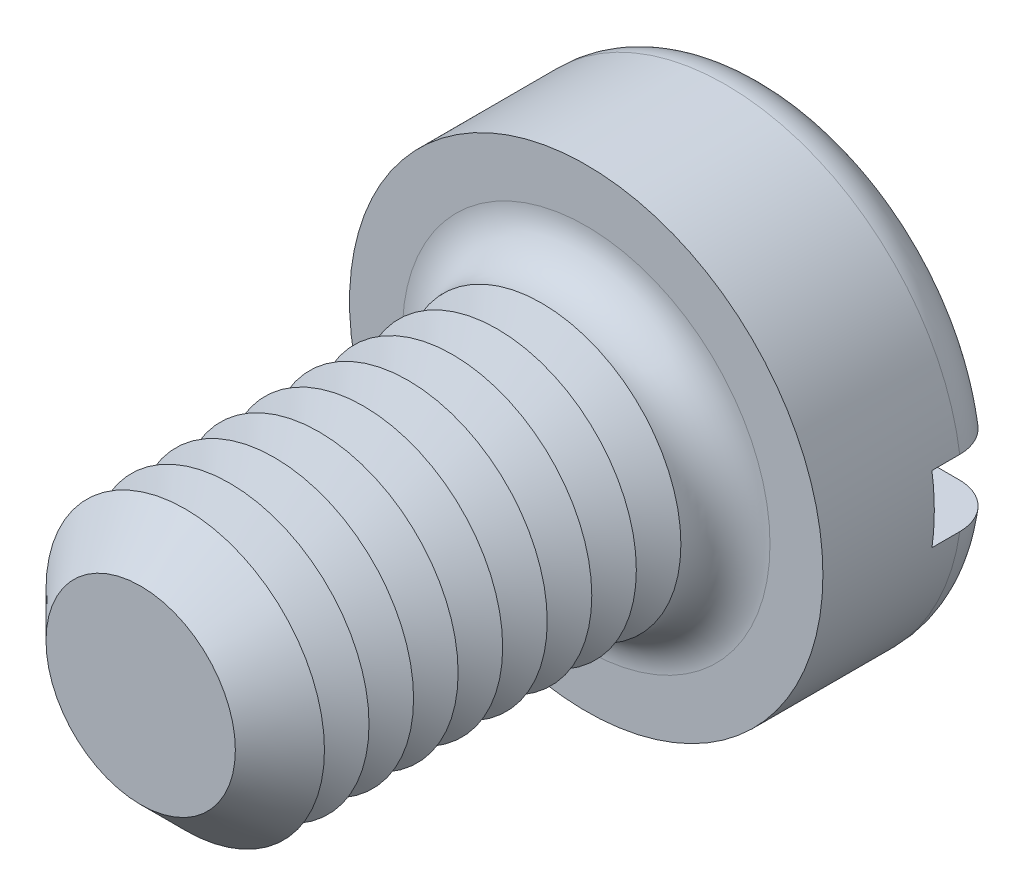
ISO-10303-21;
HEADER;
FILE_DESCRIPTION(('STEP AP214'),'2;1');
FILE_NAME('part.step','',(''),(''),'','','');
FILE_SCHEMA(('AUTOMOTIVE_DESIGN { 1 0 10303 214 1 1 1 1 }'));
ENDSEC;
DATA;
#1=APPLICATION_CONTEXT('core data for automotive mechanical design processes');
#2=APPLICATION_PROTOCOL_DEFINITION('international standard','automotive_design',2000,#1);
#3=PRODUCT_CONTEXT('',#1,'mechanical');
#4=PRODUCT('Part','Part','',(#3));
#5=PRODUCT_RELATED_PRODUCT_CATEGORY('part','',(#4));
#6=PRODUCT_DEFINITION_FORMATION('','',#4);
#7=PRODUCT_DEFINITION_CONTEXT('part definition',#1,'design');
#8=PRODUCT_DEFINITION('design','',#6,#7);
#9=PRODUCT_DEFINITION_SHAPE('','',#8);
#10=(LENGTH_UNIT() NAMED_UNIT(*) SI_UNIT(.MILLI.,.METRE.));
#11=(NAMED_UNIT(*) PLANE_ANGLE_UNIT() SI_UNIT($,.RADIAN.));
#12=(NAMED_UNIT(*) SI_UNIT($,.STERADIAN.) SOLID_ANGLE_UNIT());
#13=UNCERTAINTY_MEASURE_WITH_UNIT(LENGTH_MEASURE(1.E-05),#10,'distance_accuracy_value','');
#14=(GEOMETRIC_REPRESENTATION_CONTEXT(3) GLOBAL_UNCERTAINTY_ASSIGNED_CONTEXT((#13)) GLOBAL_UNIT_ASSIGNED_CONTEXT((#10,
#11,#12)) REPRESENTATION_CONTEXT('',''));
#15=CARTESIAN_POINT('',(0.,0.,0.));
#16=DIRECTION('',(0.,0.,1.));
#17=DIRECTION('',(1.,0.,0.));
#18=AXIS2_PLACEMENT_3D('',#15,#16,#17);
#19=CARTESIAN_POINT('',(0.,0.,-3.3));
#20=DIRECTION('',(0.,0.,1.));
#21=DIRECTION('',(1.,0.,0.));
#22=AXIS2_PLACEMENT_3D('',#19,#20,#21);
#23=PLANE('',#22);
#24=CARTESIAN_POINT('',(0.,0.,-3.3));
#25=DIRECTION('',(0.,0.,1.));
#26=DIRECTION('',(1.,0.,0.));
#27=AXIS2_PLACEMENT_3D('',#24,#25,#26);
#28=CIRCLE('',#27,3.45);
#29=CARTESIAN_POINT('',(-3.39742549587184,0.6,-3.3));
#30=VERTEX_POINT('',#29);
#31=CARTESIAN_POINT('',(3.39742549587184,0.6,-3.3));
#32=VERTEX_POINT('',#31);
#33=EDGE_CURVE('E116',#30,#32,#28,.F.);
#34=ORIENTED_EDGE('',*,*,#33,.T.);
#35=DIRECTION('',(1.,0.,0.));
#36=VECTOR('',#35,1.);
#37=CARTESIAN_POINT('',(-4.25,0.600000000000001,-3.3));
#38=LINE('',#37,#36);
#39=EDGE_CURVE('E111',#30,#32,#38,.T.);
#40=ORIENTED_EDGE('',*,*,#39,.F.);
#41=EDGE_LOOP('',(#34,#40));
#42=FACE_BOUND('',#41,.T.);
#43=ADVANCED_FACE('F39',(#42),#23,.F.);
#44=CARTESIAN_POINT('',(0.,0.,-2.5));
#45=DIRECTION('',(0.,0.,1.));
#46=DIRECTION('',(1.,0.,0.));
#47=AXIS2_PLACEMENT_3D('',#44,#45,#46);
#48=TOROIDAL_SURFACE('',#47,3.45,0.8);
#49=CARTESIAN_POINT('',(-4.06369072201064,0.600000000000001,-2.95537828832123));
#50=CARTESIAN_POINT('',(-4.03774340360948,0.600000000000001,-2.99245078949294));
#51=CARTESIAN_POINT('',(-4.00861849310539,0.600000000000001,-3.02734231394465));
#52=CARTESIAN_POINT('',(-3.94488199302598,0.600000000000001,-3.0917502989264));
#53=CARTESIAN_POINT('',(-3.91026320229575,0.600000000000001,-3.12125959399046));
#54=CARTESIAN_POINT('',(-3.83660561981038,0.600000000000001,-3.17403695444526));
#55=CARTESIAN_POINT('',(-3.79757117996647,0.6,-3.19731109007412));
#56=CARTESIAN_POINT('',(-3.71618817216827,0.6,-3.23703443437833));
#57=CARTESIAN_POINT('',(-3.67384041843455,0.6,-3.25348531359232));
#58=CARTESIAN_POINT('',(-3.58661930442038,0.6,-3.2792758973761));
#59=CARTESIAN_POINT('',(-3.54172669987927,0.6,-3.288550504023));
#60=CARTESIAN_POINT('',(-3.45102322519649,0.6,-3.29952632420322));
#61=CARTESIAN_POINT('',(-3.40521225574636,0.6,-3.30122671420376));
#62=CARTESIAN_POINT('',(-3.31340831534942,0.6,-3.29701196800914));
#63=CARTESIAN_POINT('',(-3.26741940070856,0.6,-3.29100823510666));
#64=CARTESIAN_POINT('',(-3.17708556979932,0.6,-3.27141469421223));
#65=CARTESIAN_POINT('',(-3.13274074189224,0.6,-3.25782447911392));
#66=CARTESIAN_POINT('',(-3.0466814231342,0.6,-3.22332549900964));
#67=CARTESIAN_POINT('',(-3.00498444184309,0.6,-3.20237301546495));
#68=CARTESIAN_POINT('',(-2.92572251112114,0.6,-3.15372961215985));
#69=CARTESIAN_POINT('',(-2.88815755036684,0.6,-3.12603871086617));
#70=CARTESIAN_POINT('',(-2.81847654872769,0.6,-3.06483322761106));
#71=CARTESIAN_POINT('',(-2.78633186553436,0.6,-3.03135128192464));
#72=CARTESIAN_POINT('',(-2.72824805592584,0.6,-2.95937651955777));
#73=CARTESIAN_POINT('',(-2.70230829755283,0.6,-2.92088421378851));
#74=CARTESIAN_POINT('',(-2.65791262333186,0.6,-2.84074227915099));
#75=CARTESIAN_POINT('',(-2.63932560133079,0.6,-2.79916531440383));
#76=CARTESIAN_POINT('',(-2.60958432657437,0.6,-2.7134333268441));
#77=CARTESIAN_POINT('',(-2.59842889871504,0.6,-2.66927871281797));
#78=CARTESIAN_POINT('',(-2.58411140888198,0.6,-2.58073966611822));
#79=CARTESIAN_POINT('',(-2.58077086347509,0.6,-2.5363840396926));
#80=CARTESIAN_POINT('',(-2.58167367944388,0.6,-2.44775208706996));
#81=CARTESIAN_POINT('',(-2.58591644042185,0.6,-2.40347575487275));
#82=CARTESIAN_POINT('',(-2.60175154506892,0.6,-2.31675105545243));
#83=CARTESIAN_POINT('',(-2.61326489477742,0.6,-2.27428821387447));
#84=CARTESIAN_POINT('',(-2.6431863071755,0.6,-2.19186794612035));
#85=CARTESIAN_POINT('',(-2.66159465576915,0.6,-2.15191062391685));
#86=CARTESIAN_POINT('',(-2.70494650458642,0.6,-2.07517696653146));
#87=CARTESIAN_POINT('',(-2.72995486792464,0.6,-2.03843731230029));
#88=CARTESIAN_POINT('',(-2.7856570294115,0.6,-1.96955746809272));
#89=CARTESIAN_POINT('',(-2.81635145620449,0.6,-1.93741778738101));
#90=CARTESIAN_POINT('',(-2.88329572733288,0.6,-1.87788048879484));
#91=CARTESIAN_POINT('',(-2.91965530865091,0.6,-1.85060625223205));
#92=CARTESIAN_POINT('',(-2.9963658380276,0.6,-1.80241044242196));
#93=CARTESIAN_POINT('',(-3.03671721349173,0.6,-1.78148955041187));
#94=CARTESIAN_POINT('',(-3.12111125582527,0.6,-1.74619829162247));
#95=CARTESIAN_POINT('',(-3.16521020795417,0.6,-1.73196239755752));
#96=CARTESIAN_POINT('',(-3.25516487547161,0.6,-1.71103773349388));
#97=CARTESIAN_POINT('',(-3.30102068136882,0.6,-1.70434935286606));
#98=CARTESIAN_POINT('',(-3.39352689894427,0.6,-1.69870104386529));
#99=CARTESIAN_POINT('',(-3.44018061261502,0.6,-1.69979487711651));
#100=CARTESIAN_POINT('',(-3.53263583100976,0.6,-1.70983959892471));
#101=CARTESIAN_POINT('',(-3.57843734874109,0.6,-1.71879036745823));
#102=CARTESIAN_POINT('',(-3.66763544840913,0.6,-1.74426972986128));
#103=CARTESIAN_POINT('',(-3.71104292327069,0.6,-1.76076015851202));
#104=CARTESIAN_POINT('',(-3.79442616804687,0.6,-1.80087686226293));
#105=CARTESIAN_POINT('',(-3.83440212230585,0.600000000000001,-1.82450275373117));
#106=CARTESIAN_POINT('',(-3.90929765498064,0.600000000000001,-1.87793548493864));
#107=CARTESIAN_POINT('',(-3.94426963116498,0.600000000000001,-1.90766887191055));
#108=CARTESIAN_POINT('',(-4.00864839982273,0.600000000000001,-1.9726503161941));
#109=CARTESIAN_POINT('',(-4.03805555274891,0.600000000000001,-2.00789801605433));
#110=CARTESIAN_POINT('',(-4.09009460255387,0.600000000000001,-2.08244463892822));
#111=CARTESIAN_POINT('',(-4.11280448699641,0.600000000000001,-2.12168912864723));
#112=CARTESIAN_POINT('',(-4.15124086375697,0.600000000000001,-2.2034588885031));
#113=CARTESIAN_POINT('',(-4.16696802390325,0.600000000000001,-2.24598384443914));
#114=CARTESIAN_POINT('',(-4.19085131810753,0.600000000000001,-2.33267862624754));
#115=CARTESIAN_POINT('',(-4.19907708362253,0.600000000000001,-2.37682928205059));
#116=CARTESIAN_POINT('',(-4.2079638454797,0.600000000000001,-2.46589754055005));
#117=CARTESIAN_POINT('',(-4.20862315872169,0.600000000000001,-2.51081531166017));
#118=CARTESIAN_POINT('',(-4.20236829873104,0.600000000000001,-2.59993343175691));
#119=CARTESIAN_POINT('',(-4.19548454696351,0.600000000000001,-2.64413593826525));
#120=CARTESIAN_POINT('',(-4.17439924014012,0.600000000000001,-2.73071930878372));
#121=CARTESIAN_POINT('',(-4.16020675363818,0.600000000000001,-2.77310235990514));
#122=CARTESIAN_POINT('',(-4.1318825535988,0.600000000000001,-2.83880495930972));
#123=CARTESIAN_POINT('',(-4.11991183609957,0.600000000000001,-2.86307959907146));
#124=CARTESIAN_POINT('',(-4.09356927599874,0.600000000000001,-2.91028856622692));
#125=CARTESIAN_POINT('',(-4.07919744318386,0.600000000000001,-2.9332228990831));
#126=CARTESIAN_POINT('',(-4.06369072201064,0.600000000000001,-2.95537828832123));
#127=B_SPLINE_CURVE_WITH_KNOTS('',3,(#49,#50,#51,#52,#53,#54,#55,#56,#57,#58,#59,#60,#61,#62,
#63,#64,#65,#66,#67,#68,#69,#70,#71,#72,#73,#74,#75,#76,#77,#78,#79,#80,#81,#82,#83,#84,#85,#86,
#87,#88,#89,#90,#91,#92,#93,#94,#95,#96,#97,#98,#99,#100,#101,#102,#103,#104,#105,#106,#107,
#108,#109,#110,#111,#112,#113,#114,#115,#116,#117,#118,#119,#120,#121,#122,#123,#124,#125,#126),
.UNSPECIFIED.,.T.,.F.,(4,2,2,2,2,2,2,2,2,2,2,2,2,2,2,2,2,2,2,2,2,2,2,2,2,2,2,2,2,2,2,2,2,2,2,2,
2,2,4),(0.,0.13565225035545,0.271483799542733,0.407182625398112,0.542848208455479,
0.679730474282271,0.816627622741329,0.955113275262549,1.09360635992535,1.23293614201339,
1.37226554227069,1.51083389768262,1.64938813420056,1.78534653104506,1.92128342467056,
2.0540840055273,2.18687407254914,2.31824564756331,2.44962267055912,2.58234229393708,
2.71507659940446,2.85080630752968,2.98655056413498,3.12491938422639,3.26329534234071,
3.40262816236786,3.54195885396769,3.68059194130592,3.81921757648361,3.95626453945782,
4.09330262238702,4.2286754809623,4.36403538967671,4.49812564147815,4.63224572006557,
4.76582687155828,4.89924267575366,4.98031194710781,5.0613808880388),.UNSPECIFIED.);
#128=CARTESIAN_POINT('',(-4.20743389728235,0.600000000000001,-2.50000000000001));
#129=VERTEX_POINT('',#128);
#130=EDGE_CURVE('E243',#129,#30,#127,.T.);
#131=ORIENTED_EDGE('',*,*,#130,.F.);
#132=CARTESIAN_POINT('',(0.,0.,-2.5));
#133=DIRECTION('',(0.,0.,1.));
#134=DIRECTION('',(1.,0.,0.));
#135=AXIS2_PLACEMENT_3D('',#132,#133,#134);
#136=CIRCLE('',#135,4.25);
#137=CARTESIAN_POINT('',(4.20743389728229,0.599999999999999,-2.5));
#138=VERTEX_POINT('',#137);
#139=EDGE_CURVE('E125',#138,#129,#136,.T.);
#140=ORIENTED_EDGE('',*,*,#139,.F.);
#141=CARTESIAN_POINT('',(2.63947327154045,0.6,-2.79608831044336));
#142=CARTESIAN_POINT('',(2.65655980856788,0.6,-2.83790320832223));
#143=CARTESIAN_POINT('',(2.67725642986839,0.6,-2.87828303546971));
#144=CARTESIAN_POINT('',(2.72519250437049,0.6,-2.95500233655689));
#145=CARTESIAN_POINT('',(2.75244152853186,0.6,-2.9913357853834));
#146=CARTESIAN_POINT('',(2.81257938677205,0.6,-3.05889430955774));
#147=CARTESIAN_POINT('',(2.84545995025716,0.6,-3.09012674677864));
#148=CARTESIAN_POINT('',(2.91591143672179,0.6,-3.14672620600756));
#149=CARTESIAN_POINT('',(2.95348119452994,0.6,-3.17209468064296));
#150=CARTESIAN_POINT('',(3.03291143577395,0.6,-3.21669611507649));
#151=CARTESIAN_POINT('',(3.07483186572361,0.6,-3.23582234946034));
#152=CARTESIAN_POINT('',(3.16126659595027,0.6,-3.26686062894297));
#153=CARTESIAN_POINT('',(3.2057811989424,0.6,-3.27877183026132));
#154=CARTESIAN_POINT('',(3.29669878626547,0.6,-3.29514603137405));
#155=CARTESIAN_POINT('',(3.34311773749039,0.6,-3.29952056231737));
#156=CARTESIAN_POINT('',(3.43603189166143,0.6,-3.30040472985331));
#157=CARTESIAN_POINT('',(3.48252709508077,0.6,-3.29691431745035));
#158=CARTESIAN_POINT('',(3.57420049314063,0.6,-3.28214240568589));
#159=CARTESIAN_POINT('',(3.61938038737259,0.6,-3.27087147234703));
#160=CARTESIAN_POINT('',(3.70717477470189,0.6,-3.24082890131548));
#161=CARTESIAN_POINT('',(3.74978938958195,0.6,-3.22205762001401));
#162=CARTESIAN_POINT('',(3.83078828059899,0.6,-3.17773607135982));
#163=CARTESIAN_POINT('',(3.86921015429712,0.599999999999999,-3.15225453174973));
#164=CARTESIAN_POINT('',(3.94116038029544,0.599999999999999,-3.09512672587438));
#165=CARTESIAN_POINT('',(3.9746890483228,0.599999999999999,-3.06348085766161));
#166=CARTESIAN_POINT('',(4.03545911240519,0.599999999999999,-2.99534640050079));
#167=CARTESIAN_POINT('',(4.06277344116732,0.599999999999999,-2.95892285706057));
#168=CARTESIAN_POINT('',(4.11082191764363,0.599999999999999,-2.88196698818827));
#169=CARTESIAN_POINT('',(4.13155647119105,0.599999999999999,-2.84143491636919));
#170=CARTESIAN_POINT('',(4.16563480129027,0.599999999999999,-2.75787550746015));
#171=CARTESIAN_POINT('',(4.1790544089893,0.599999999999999,-2.71487908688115));
#172=CARTESIAN_POINT('',(4.19843340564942,0.599999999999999,-2.62723691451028));
#173=CARTESIAN_POINT('',(4.20439310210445,0.599999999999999,-2.58259123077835));
#174=CARTESIAN_POINT('',(4.2086595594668,0.599999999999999,-2.49321831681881));
#175=CARTESIAN_POINT('',(4.20701422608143,0.599999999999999,-2.4484933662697));
#176=CARTESIAN_POINT('',(4.1962295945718,0.599999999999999,-2.35995704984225));
#177=CARTESIAN_POINT('',(4.18709040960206,0.599999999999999,-2.31614567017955));
#178=CARTESIAN_POINT('',(4.16160290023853,0.599999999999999,-2.23072100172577));
#179=CARTESIAN_POINT('',(4.14526169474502,0.599999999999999,-2.18910558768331));
#180=CARTESIAN_POINT('',(4.10585410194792,0.599999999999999,-2.10919238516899));
#181=CARTESIAN_POINT('',(4.08278762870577,0.599999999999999,-2.07089463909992));
#182=CARTESIAN_POINT('',(4.030487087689,0.599999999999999,-1.99851484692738));
#183=CARTESIAN_POINT('',(4.00122628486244,0.599999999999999,-1.9644521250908));
#184=CARTESIAN_POINT('',(3.93744772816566,0.599999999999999,-1.90166877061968));
#185=CARTESIAN_POINT('',(3.90292977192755,0.599999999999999,-1.87294834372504));
#186=CARTESIAN_POINT('',(3.82928727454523,0.599999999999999,-1.82137853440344));
#187=CARTESIAN_POINT('',(3.79012374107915,0.6,-1.79858484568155));
#188=CARTESIAN_POINT('',(3.70856025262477,0.6,-1.75980712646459));
#189=CARTESIAN_POINT('',(3.66616010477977,0.6,-1.74382350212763));
#190=CARTESIAN_POINT('',(3.57878495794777,0.6,-1.71891499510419));
#191=CARTESIAN_POINT('',(3.53378519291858,0.6,-1.71007699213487));
#192=CARTESIAN_POINT('',(3.44294322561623,0.6,-1.69998722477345));
#193=CARTESIAN_POINT('',(3.3971009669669,0.6,-1.69873596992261));
#194=CARTESIAN_POINT('',(3.30531297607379,0.6,-1.70385439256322));
#195=CARTESIAN_POINT('',(3.25937213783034,0.6,-1.71031204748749));
#196=CARTESIAN_POINT('',(3.1692099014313,0.6,-1.73080107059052));
#197=CARTESIAN_POINT('',(3.12498860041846,0.6,-1.74483286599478));
#198=CARTESIAN_POINT('',(3.03926209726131,0.6,-1.78018941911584));
#199=CARTESIAN_POINT('',(2.99777407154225,0.6,-1.80155586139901));
#200=CARTESIAN_POINT('',(2.91899881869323,0.6,-1.85098881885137));
#201=CARTESIAN_POINT('',(2.88171158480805,0.6,-1.8790553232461));
#202=CARTESIAN_POINT('',(2.81266124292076,0.6,-1.94094884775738));
#203=CARTESIAN_POINT('',(2.78086710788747,0.6,-1.97474122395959));
#204=CARTESIAN_POINT('',(2.72353615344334,0.6,-2.0472724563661));
#205=CARTESIAN_POINT('',(2.69799841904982,0.6,-2.08601058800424));
#206=CARTESIAN_POINT('',(2.65444718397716,0.6,-2.16655019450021));
#207=CARTESIAN_POINT('',(2.63629889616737,0.6,-2.20827875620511));
#208=CARTESIAN_POINT('',(2.60744942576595,0.6,-2.29424821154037));
#209=CARTESIAN_POINT('',(2.59674901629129,0.6,-2.33848936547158));
#210=CARTESIAN_POINT('',(2.5833312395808,0.6,-2.42714258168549));
#211=CARTESIAN_POINT('',(2.58043995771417,0.6,-2.47152848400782));
#212=CARTESIAN_POINT('',(2.58224493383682,0.6,-2.56010574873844));
#213=CARTESIAN_POINT('',(2.58693104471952,0.6,-2.60429729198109));
#214=CARTESIAN_POINT('',(2.60020046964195,0.6,-2.67311978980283));
#215=CARTESIAN_POINT('',(2.60635343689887,0.6,-2.69824441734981));
#216=CARTESIAN_POINT('',(2.62110140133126,0.6,-2.74776540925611));
#217=CARTESIAN_POINT('',(2.62969634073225,0.6,-2.77216179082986));
#218=CARTESIAN_POINT('',(2.63947327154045,0.6,-2.79608831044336));
#219=B_SPLINE_CURVE_WITH_KNOTS('',3,(#141,#142,#143,#144,#145,#146,#147,#148,#149,#150,#151,
#152,#153,#154,#155,#156,#157,#158,#159,#160,#161,#162,#163,#164,#165,#166,#167,#168,#169,#170,
#171,#172,#173,#174,#175,#176,#177,#178,#179,#180,#181,#182,#183,#184,#185,#186,#187,#188,#189,
#190,#191,#192,#193,#194,#195,#196,#197,#198,#199,#200,#201,#202,#203,#204,#205,#206,#207,#208,
#209,#210,#211,#212,#213,#214,#215,#216,#217,#218),.UNSPECIFIED.,.T.,.F.,(4,2,2,2,2,2,2,2,2,2,2,
2,2,2,2,2,2,2,2,2,2,2,2,2,2,2,2,2,2,2,2,2,2,2,2,2,2,2,4),(0.,0.135416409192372,
0.271031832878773,0.406449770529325,0.541834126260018,0.679424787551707,0.817031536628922,
0.956242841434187,1.09545501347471,1.23447850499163,1.37349539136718,1.51114036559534,
1.64877645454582,1.78470267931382,1.92062051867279,2.05510117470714,2.1895762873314,
2.32320547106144,2.45683263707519,2.59032801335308,2.72382509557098,2.85791055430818,
2.99200117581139,3.12730969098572,3.26262627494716,3.39956435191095,3.53651162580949,
3.67503685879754,3.81356990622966,3.95290367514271,4.09223721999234,4.23075602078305,
4.36925455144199,4.50509949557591,4.6409585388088,4.77376594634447,4.90639565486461,
4.98388287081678,5.06136825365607),.UNSPECIFIED.);
#220=EDGE_CURVE('E245',#32,#138,#219,.T.);
#221=ORIENTED_EDGE('',*,*,#220,.F.);
#222=ORIENTED_EDGE('',*,*,#33,.F.);
#223=EDGE_LOOP('',(#131,#140,#221,#222));
#224=FACE_BOUND('',#223,.T.);
#225=ADVANCED_FACE('F227',(#224),#48,.T.);
#226=CARTESIAN_POINT('',(0.,0.,-3.3));
#227=DIRECTION('',(0.,0.,1.));
#228=DIRECTION('',(1.,0.,0.));
#229=AXIS2_PLACEMENT_3D('',#226,#227,#228);
#230=CYLINDRICAL_SURFACE('',#229,4.25);
#231=DIRECTION('',(0.,0.,1.));
#232=VECTOR('',#231,1.);
#233=CARTESIAN_POINT('',(4.20743389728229,0.599999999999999,-3.3));
#234=LINE('',#233,#232);
#235=CARTESIAN_POINT('',(4.20743389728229,0.599999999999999,-2.));
#236=VERTEX_POINT('',#235);
#237=EDGE_CURVE('E260',#138,#236,#234,.T.);
#238=ORIENTED_EDGE('',*,*,#237,.F.);
#239=ORIENTED_EDGE('',*,*,#139,.T.);
#240=DIRECTION('',(0.,0.,1.));
#241=VECTOR('',#240,1.);
#242=CARTESIAN_POINT('',(-4.20743389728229,0.600000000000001,-3.3));
#243=LINE('',#242,#241);
#244=CARTESIAN_POINT('',(-4.20743389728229,0.600000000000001,-2.));
#245=VERTEX_POINT('',#244);
#246=EDGE_CURVE('E63',#245,#129,#243,.F.);
#247=ORIENTED_EDGE('',*,*,#246,.F.);
#248=CARTESIAN_POINT('',(0.,0.,-2.));
#249=DIRECTION('',(0.,0.,-1.));
#250=DIRECTION('',(-1.,0.,0.));
#251=AXIS2_PLACEMENT_3D('',#248,#249,#250);
#252=CIRCLE('',#251,4.25);
#253=CARTESIAN_POINT('',(-4.20743389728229,-0.599999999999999,-2.));
#254=VERTEX_POINT('',#253);
#255=EDGE_CURVE('E43',#245,#254,#252,.F.);
#256=ORIENTED_EDGE('',*,*,#255,.T.);
#257=DIRECTION('',(0.,0.,1.));
#258=VECTOR('',#257,1.);
#259=CARTESIAN_POINT('',(-4.20743389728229,-0.599999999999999,-3.3));
#260=LINE('',#259,#258);
#261=CARTESIAN_POINT('',(-4.20743389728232,-0.599999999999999,-2.5));
#262=VERTEX_POINT('',#261);
#263=EDGE_CURVE('E257',#262,#254,#260,.T.);
#264=ORIENTED_EDGE('',*,*,#263,.F.);
#265=CARTESIAN_POINT('',(4.20743389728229,-0.600000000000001,-2.5));
#266=VERTEX_POINT('',#265);
#267=EDGE_CURVE('E127',#262,#266,#136,.T.);
#268=ORIENTED_EDGE('',*,*,#267,.T.);
#269=DIRECTION('',(0.,0.,1.));
#270=VECTOR('',#269,1.);
#271=CARTESIAN_POINT('',(4.20743389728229,-0.600000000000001,-3.3));
#272=LINE('',#271,#270);
#273=CARTESIAN_POINT('',(4.20743389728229,-0.600000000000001,-2.));
#274=VERTEX_POINT('',#273);
#275=EDGE_CURVE('E55',#274,#266,#272,.F.);
#276=ORIENTED_EDGE('',*,*,#275,.F.);
#277=EDGE_CURVE('E11',#274,#236,#252,.F.);
#278=ORIENTED_EDGE('',*,*,#277,.T.);
#279=EDGE_LOOP('',(#238,#239,#247,#256,#264,#268,#276,#278));
#280=FACE_BOUND('',#279,.T.);
#281=CARTESIAN_POINT('',(0.,0.,0.));
#282=DIRECTION('',(0.,0.,1.));
#283=DIRECTION('',(1.,0.,0.));
#284=AXIS2_PLACEMENT_3D('',#281,#282,#283);
#285=CIRCLE('',#284,4.25);
#286=CARTESIAN_POINT('',(4.25,0.,0.));
#287=VERTEX_POINT('',#286);
#288=EDGE_CURVE('E263',#287,#287,#285,.T.);
#289=ORIENTED_EDGE('',*,*,#288,.F.);
#290=EDGE_LOOP('',(#289));
#291=FACE_BOUND('',#290,.T.);
#292=ADVANCED_FACE('F223',(#280,#291),#230,.T.);
#293=CARTESIAN_POINT('',(3.39742549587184,-0.6,-3.3));
#294=VERTEX_POINT('',#293);
#295=CARTESIAN_POINT('',(-3.39742549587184,-0.6,-3.3));
#296=VERTEX_POINT('',#295);
#297=EDGE_CURVE('E109',#294,#296,#28,.F.);
#298=ORIENTED_EDGE('',*,*,#297,.T.);
#299=DIRECTION('',(-1.,0.,0.));
#300=VECTOR('',#299,1.);
#301=CARTESIAN_POINT('',(-4.25,-0.599999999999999,-3.3));
#302=LINE('',#301,#300);
#303=EDGE_CURVE('E96',#294,#296,#302,.T.);
#304=ORIENTED_EDGE('',*,*,#303,.F.);
#305=EDGE_LOOP('',(#298,#304));
#306=FACE_BOUND('',#305,.T.);
#307=ADVANCED_FACE('F108',(#306),#23,.F.);
#308=CARTESIAN_POINT('',(0.,0.,0.));
#309=DIRECTION('',(0.,0.,1.));
#310=DIRECTION('',(1.,0.,0.));
#311=AXIS2_PLACEMENT_3D('',#308,#309,#310);
#312=PLANE('',#311);
#313=CARTESIAN_POINT('',(0.,0.,0.));
#314=DIRECTION('',(0.,0.,1.));
#315=DIRECTION('',(1.,0.,0.));
#316=AXIS2_PLACEMENT_3D('',#313,#314,#315);
#317=CIRCLE('',#316,3.3);
#318=CARTESIAN_POINT('',(3.3,0.,0.));
#319=VERTEX_POINT('',#318);
#320=EDGE_CURVE('E115',#319,#319,#317,.F.);
#321=ORIENTED_EDGE('',*,*,#320,.T.);
#322=EDGE_LOOP('',(#321));
#323=FACE_BOUND('',#322,.T.);
#324=ORIENTED_EDGE('',*,*,#288,.T.);
#325=EDGE_LOOP('',(#324));
#326=FACE_BOUND('',#325,.T.);
#327=ADVANCED_FACE('F222',(#323,#326),#312,.T.);
#328=CARTESIAN_POINT('',(-4.06369072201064,-0.599999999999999,-2.95537828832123));
#329=CARTESIAN_POINT('',(-4.08928577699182,-0.599999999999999,-2.91880204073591));
#330=CARTESIAN_POINT('',(-4.11182555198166,-0.599999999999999,-2.88005030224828));
#331=CARTESIAN_POINT('',(-4.15010404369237,-0.599999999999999,-2.79928452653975));
#332=CARTESIAN_POINT('',(-4.16583526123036,-0.599999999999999,-2.75726695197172));
#333=CARTESIAN_POINT('',(-4.19000286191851,-0.599999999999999,-2.67118996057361));
#334=CARTESIAN_POINT('',(-4.19844101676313,-0.599999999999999,-2.62713104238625));
#335=CARTESIAN_POINT('',(-4.20777174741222,-0.599999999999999,-2.53823222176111));
#336=CARTESIAN_POINT('',(-4.20866608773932,-0.599999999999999,-2.49339250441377));
#337=CARTESIAN_POINT('',(-4.20289683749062,-0.599999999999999,-2.40433856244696));
#338=CARTESIAN_POINT('',(-4.19625607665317,-0.599999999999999,-2.36012285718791));
#339=CARTESIAN_POINT('',(-4.17565084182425,-0.599999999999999,-2.27343166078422));
#340=CARTESIAN_POINT('',(-4.16168615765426,-0.599999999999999,-2.23095621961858));
#341=CARTESIAN_POINT('',(-4.12683188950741,-0.599999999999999,-2.14890863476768));
#342=CARTESIAN_POINT('',(-4.10593663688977,-0.599999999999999,-2.10933890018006));
#343=CARTESIAN_POINT('',(-4.05783763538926,-0.599999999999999,-2.03424145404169));
#344=CARTESIAN_POINT('',(-4.03063375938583,-0.599999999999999,-1.99871382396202));
#345=CARTESIAN_POINT('',(-3.97052236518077,-0.599999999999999,-1.93246905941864));
#346=CARTESIAN_POINT('',(-3.93758114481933,-0.599999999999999,-1.90178251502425));
#347=CARTESIAN_POINT('',(-3.86706007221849,-0.599999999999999,-1.84630837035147));
#348=CARTESIAN_POINT('',(-3.82948001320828,-0.6,-1.82152103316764));
#349=CARTESIAN_POINT('',(-3.75033766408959,-0.6,-1.77826995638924));
#350=CARTESIAN_POINT('',(-3.70873831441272,-0.6,-1.7598740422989));
#351=CARTESIAN_POINT('',(-3.62306661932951,-0.6,-1.73023196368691));
#352=CARTESIAN_POINT('',(-3.57899411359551,-0.6,-1.71898626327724));
#353=CARTESIAN_POINT('',(-3.48904845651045,-0.6,-1.70382025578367));
#354=CARTESIAN_POINT('',(-3.44315982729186,-0.6,-1.69999172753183));
#355=CARTESIAN_POINT('',(-3.35138360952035,-0.6,-1.7000083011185));
#356=CARTESIAN_POINT('',(-3.30549602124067,-0.6,-1.70385391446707));
#357=CARTESIAN_POINT('',(-3.21452492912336,-0.6,-1.71917227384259));
#358=CARTESIAN_POINT('',(-3.16945455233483,-0.6,-1.73072307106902));
#359=CARTESIAN_POINT('',(-3.08188104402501,-0.6,-1.76120640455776));
#360=CARTESIAN_POINT('',(-3.0393780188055,-0.6,-1.78013924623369));
#361=CARTESIAN_POINT('',(-2.95805296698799,-0.6,-1.82493384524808));
#362=CARTESIAN_POINT('',(-2.9192403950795,-0.6,-1.85081278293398));
#363=CARTESIAN_POINT('',(-2.84656695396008,-0.6,-1.90878317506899));
#364=CARTESIAN_POINT('',(-2.81270591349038,-0.6,-1.94087441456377));
#365=CARTESIAN_POINT('',(-2.75131050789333,-0.6,-2.01002500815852));
#366=CARTESIAN_POINT('',(-2.72371339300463,-0.6,-2.04702860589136));
#367=CARTESIAN_POINT('',(-2.67528742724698,-0.6,-2.12522869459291));
#368=CARTESIAN_POINT('',(-2.65445765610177,-0.6,-2.1664246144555));
#369=CARTESIAN_POINT('',(-2.62065354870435,-0.6,-2.25087266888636));
#370=CARTESIAN_POINT('',(-2.60751663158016,-0.6,-2.29405971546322));
#371=CARTESIAN_POINT('',(-2.58885106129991,-0.6,-2.38204659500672));
#372=CARTESIAN_POINT('',(-2.58332131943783,-0.6,-2.42684619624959));
#373=CARTESIAN_POINT('',(-2.58009777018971,-0.6,-2.51580379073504));
#374=CARTESIAN_POINT('',(-2.58224575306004,-0.6,-2.55995612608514));
#375=CARTESIAN_POINT('',(-2.59395205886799,-0.6,-2.64726495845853));
#376=CARTESIAN_POINT('',(-2.60351013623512,-0.6,-2.69042148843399));
#377=CARTESIAN_POINT('',(-2.62967159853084,-0.6,-2.77438771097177));
#378=CARTESIAN_POINT('',(-2.64625243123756,-0.6,-2.81520444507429));
#379=CARTESIAN_POINT('',(-2.68592348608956,-0.6,-2.89353901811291));
#380=CARTESIAN_POINT('',(-2.70901418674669,-0.6,-2.9310566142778));
#381=CARTESIAN_POINT('',(-2.7614318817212,-0.6,-3.00240040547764));
#382=CARTESIAN_POINT('',(-2.79085487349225,-0.6,-3.03615603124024));
#383=CARTESIAN_POINT('',(-2.85483456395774,-0.6,-3.09838834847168));
#384=CARTESIAN_POINT('',(-2.88939187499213,-0.6,-3.12686440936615));
#385=CARTESIAN_POINT('',(-2.96351967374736,-0.6,-3.17841283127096));
#386=CARTESIAN_POINT('',(-3.00318741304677,-0.6,-3.20134539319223));
#387=CARTESIAN_POINT('',(-3.08576649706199,-0.6,-3.24034364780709));
#388=CARTESIAN_POINT('',(-3.12867814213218,-0.6,-3.25640870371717));
#389=CARTESIAN_POINT('',(-3.21724048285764,-0.6,-3.28143816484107));
#390=CARTESIAN_POINT('',(-3.26292314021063,-0.6,-3.29028963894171));
#391=CARTESIAN_POINT('',(-3.35512527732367,-0.6,-3.30021681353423));
#392=CARTESIAN_POINT('',(-3.40164474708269,-0.6,-3.30129260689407));
#393=CARTESIAN_POINT('',(-3.49429978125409,-0.6,-3.29560589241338));
#394=CARTESIAN_POINT('',(-3.54043436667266,-0.6,-3.28882735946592));
#395=CARTESIAN_POINT('',(-3.63090382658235,-0.6,-3.26755492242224));
#396=CARTESIAN_POINT('',(-3.67523831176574,-0.6,-3.25305935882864));
#397=CARTESIAN_POINT('',(-3.76046509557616,-0.6,-3.21686867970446));
#398=CARTESIAN_POINT('',(-3.80138087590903,-0.599999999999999,-3.1952288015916));
#399=CARTESIAN_POINT('',(-3.8788986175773,-0.599999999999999,-3.14531817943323));
#400=CARTESIAN_POINT('',(-3.91550599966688,-0.599999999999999,-3.11705590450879));
#401=CARTESIAN_POINT('',(-3.97074313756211,-0.599999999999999,-3.06628809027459));
#402=CARTESIAN_POINT('',(-3.99100743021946,-0.599999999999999,-3.04553102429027));
#403=CARTESIAN_POINT('',(-4.02917385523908,-0.599999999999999,-3.00194762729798));
#404=CARTESIAN_POINT('',(-4.04707600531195,-0.599999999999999,-2.97912131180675));
#405=CARTESIAN_POINT('',(-4.06369072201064,-0.599999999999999,-2.95537828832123));
#406=B_SPLINE_CURVE_WITH_KNOTS('',3,(#328,#329,#330,#331,#332,#333,#334,#335,#336,#337,#338,
#339,#340,#341,#342,#343,#344,#345,#346,#347,#348,#349,#350,#351,#352,#353,#354,#355,#356,#357,
#358,#359,#360,#361,#362,#363,#364,#365,#366,#367,#368,#369,#370,#371,#372,#373,#374,#375,#376,
#377,#378,#379,#380,#381,#382,#383,#384,#385,#386,#387,#388,#389,#390,#391,#392,#393,#394,#395,
#396,#397,#398,#399,#400,#401,#402,#403,#404,#405),.UNSPECIFIED.,.T.,.F.,(4,2,2,2,2,2,2,2,2,2,2,
2,2,2,2,2,2,2,2,2,2,2,2,2,2,2,2,2,2,2,2,2,2,2,2,2,2,2,4),(0.,0.133821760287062,
0.267790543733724,0.401726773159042,0.535631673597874,0.669131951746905,0.802636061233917,
0.936249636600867,1.06986590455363,1.2042952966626,1.3387306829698,1.47455198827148,
1.61038210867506,1.74788249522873,1.88539204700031,2.02431612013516,2.16324594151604,
2.30252260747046,2.4417944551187,2.57960263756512,2.71739207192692,2.85215325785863,
2.98689515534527,3.11887666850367,3.25085380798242,3.38241030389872,3.51397647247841,
3.64769871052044,3.78143690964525,3.91826005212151,4.05509587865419,4.19403485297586,
4.33297216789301,4.47219345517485,4.61144469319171,4.74964356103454,4.887666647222,
4.97453605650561,5.06140481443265),.UNSPECIFIED.);
#407=EDGE_CURVE('E103',#296,#262,#406,.T.);
#408=ORIENTED_EDGE('',*,*,#407,.F.);
#409=ORIENTED_EDGE('',*,*,#297,.F.);
#410=CARTESIAN_POINT('',(2.63947327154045,-0.6,-2.79608831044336));
#411=CARTESIAN_POINT('',(2.62285766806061,-0.6,-2.75541510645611));
#412=CARTESIAN_POINT('',(2.60963282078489,-0.6,-2.71332585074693));
#413=CARTESIAN_POINT('',(2.59042394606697,-0.6,-2.62749460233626));
#414=CARTESIAN_POINT('',(2.58444686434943,-0.6,-2.58375106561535));
#415=CARTESIAN_POINT('',(2.57995287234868,-0.6,-2.49588524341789));
#416=CARTESIAN_POINT('',(2.58143477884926,-0.6,-2.45176301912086));
#417=CARTESIAN_POINT('',(2.59180622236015,-0.6,-2.36440906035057));
#418=CARTESIAN_POINT('',(2.60069434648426,-0.6,-2.32117715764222));
#419=CARTESIAN_POINT('',(2.62554964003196,-0.6,-2.23689909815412));
#420=CARTESIAN_POINT('',(2.6415022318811,-0.6,-2.19584863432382));
#421=CARTESIAN_POINT('',(2.67996913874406,-0.6,-2.11694797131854));
#422=CARTESIAN_POINT('',(2.70248409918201,-0.6,-2.07909808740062));
#423=CARTESIAN_POINT('',(2.75378972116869,-0.6,-2.00702296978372));
#424=CARTESIAN_POINT('',(2.7826732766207,-0.6,-1.97286389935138));
#425=CARTESIAN_POINT('',(2.84564717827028,-0.6,-1.90974167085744));
#426=CARTESIAN_POINT('',(2.87973812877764,-0.6,-1.88077911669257));
#427=CARTESIAN_POINT('',(2.95300941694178,-0.6,-1.82817307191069));
#428=CARTESIAN_POINT('',(2.99228920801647,-0.6,-1.8046680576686));
#429=CARTESIAN_POINT('',(3.07419050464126,-0.6,-1.76446470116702));
#430=CARTESIAN_POINT('',(3.11681231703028,-0.6,-1.74776698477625));
#431=CARTESIAN_POINT('',(3.20492149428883,-0.6,-1.72140945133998));
#432=CARTESIAN_POINT('',(3.25044365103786,-0.6,-1.71186578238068));
#433=CARTESIAN_POINT('',(3.34244451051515,-0.6,-1.70053183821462));
#434=CARTESIAN_POINT('',(3.38892324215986,-0.6,-1.69874179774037));
#435=CARTESIAN_POINT('',(3.48165030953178,-0.6,-1.70299737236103));
#436=CARTESIAN_POINT('',(3.52789766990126,-0.6,-1.70906439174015));
#437=CARTESIAN_POINT('',(3.61869999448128,-0.6,-1.72893768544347));
#438=CARTESIAN_POINT('',(3.6632550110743,-0.6,-1.742743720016));
#439=CARTESIAN_POINT('',(3.7490339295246,-0.6,-1.77760539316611));
#440=CARTESIAN_POINT('',(3.79028083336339,-0.600000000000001,-1.79860440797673));
#441=CARTESIAN_POINT('',(3.86860401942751,-0.600000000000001,-1.84731105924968));
#442=CARTESIAN_POINT('',(3.90568056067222,-0.600000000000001,-1.87501827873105));
#443=CARTESIAN_POINT('',(3.97412845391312,-0.600000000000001,-1.93599408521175));
#444=CARTESIAN_POINT('',(4.00556369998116,-0.600000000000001,-1.96919094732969));
#445=CARTESIAN_POINT('',(4.06233546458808,-0.600000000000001,-2.0404445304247));
#446=CARTESIAN_POINT('',(4.08767237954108,-0.600000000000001,-2.07850093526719));
#447=CARTESIAN_POINT('',(4.13122502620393,-0.600000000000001,-2.15791791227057));
#448=CARTESIAN_POINT('',(4.14951966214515,-0.600000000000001,-2.19923522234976));
#449=CARTESIAN_POINT('',(4.17884974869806,-0.600000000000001,-2.28437065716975));
#450=CARTESIAN_POINT('',(4.18988555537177,-0.600000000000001,-2.32818865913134));
#451=CARTESIAN_POINT('',(4.20430724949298,-0.600000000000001,-2.41670951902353));
#452=CARTESIAN_POINT('',(4.2077528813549,-0.600000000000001,-2.46140265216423));
#453=CARTESIAN_POINT('',(4.20706844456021,-0.600000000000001,-2.55073028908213));
#454=CARTESIAN_POINT('',(4.20293856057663,-0.600000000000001,-2.595364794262));
#455=CARTESIAN_POINT('',(4.18724926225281,-0.600000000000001,-2.68317733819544));
#456=CARTESIAN_POINT('',(4.17571081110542,-0.600000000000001,-2.72635912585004));
#457=CARTESIAN_POINT('',(4.14556645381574,-0.600000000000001,-2.81017999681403));
#458=CARTESIAN_POINT('',(4.12696052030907,-0.600000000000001,-2.85081907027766));
#459=CARTESIAN_POINT('',(4.08317014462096,-0.600000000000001,-2.92852328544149));
#460=CARTESIAN_POINT('',(4.0579684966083,-0.600000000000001,-2.96557872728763));
#461=CARTESIAN_POINT('',(4.00174565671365,-0.600000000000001,-3.034972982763));
#462=CARTESIAN_POINT('',(3.97072429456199,-0.600000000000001,-3.06731165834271));
#463=CARTESIAN_POINT('',(3.90349659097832,-0.600000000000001,-3.12662735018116));
#464=CARTESIAN_POINT('',(3.86725240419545,-0.600000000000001,-3.15356146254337));
#465=CARTESIAN_POINT('',(3.79079809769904,-0.600000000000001,-3.20104156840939));
#466=CARTESIAN_POINT('',(3.75058775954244,-0.6,-3.22158720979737));
#467=CARTESIAN_POINT('',(3.6668595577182,-0.6,-3.25595832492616));
#468=CARTESIAN_POINT('',(3.62330947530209,-0.6,-3.26970530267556));
#469=CARTESIAN_POINT('',(3.53453348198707,-0.6,-3.28979004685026));
#470=CARTESIAN_POINT('',(3.48930745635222,-0.6,-3.29612730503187));
#471=CARTESIAN_POINT('',(3.39787506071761,-0.6,-3.30128612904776));
#472=CARTESIAN_POINT('',(3.35166346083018,-0.6,-3.30001513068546));
#473=CARTESIAN_POINT('',(3.26009663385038,-0.6,-3.28980210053));
#474=CARTESIAN_POINT('',(3.21474142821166,-0.6,-3.28085987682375));
#475=CARTESIAN_POINT('',(3.12577990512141,-0.6,-3.2554540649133));
#476=CARTESIAN_POINT('',(3.08219120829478,-0.6,-3.23892872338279));
#477=CARTESIAN_POINT('',(2.99839730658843,-0.6,-3.1987810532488));
#478=CARTESIAN_POINT('',(2.95819301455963,-0.6,-3.17515681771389));
#479=CARTESIAN_POINT('',(2.88239372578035,-0.6,-3.12147666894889));
#480=CARTESIAN_POINT('',(2.84679445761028,-0.6,-3.09142678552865));
#481=CARTESIAN_POINT('',(2.78127483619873,-0.6,-3.02571584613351));
#482=CARTESIAN_POINT('',(2.75134725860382,-0.6,-2.99006203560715));
#483=CARTESIAN_POINT('',(2.70767232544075,-0.6,-2.92780516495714));
#484=CARTESIAN_POINT('',(2.69197340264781,-0.6,-2.90254809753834));
#485=CARTESIAN_POINT('',(2.66349078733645,-0.6,-2.8504392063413));
#486=CARTESIAN_POINT('',(2.65070705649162,-0.6,-2.82358740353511));
#487=CARTESIAN_POINT('',(2.63947327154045,-0.6,-2.79608831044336));
#488=B_SPLINE_CURVE_WITH_KNOTS('',3,(#410,#411,#412,#413,#414,#415,#416,#417,#418,#419,#420,
#421,#422,#423,#424,#425,#426,#427,#428,#429,#430,#431,#432,#433,#434,#435,#436,#437,#438,#439,
#440,#441,#442,#443,#444,#445,#446,#447,#448,#449,#450,#451,#452,#453,#454,#455,#456,#457,#458,
#459,#460,#461,#462,#463,#464,#465,#466,#467,#468,#469,#470,#471,#472,#473,#474,#475,#476,#477,
#478,#479,#480,#481,#482,#483,#484,#485,#486,#487),.UNSPECIFIED.,.T.,.F.,(4,2,2,2,2,2,2,2,2,2,2,
2,2,2,2,2,2,2,2,2,2,2,2,2,2,2,2,2,2,2,2,2,2,2,2,2,2,2,4),(0.,0.131701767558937,
0.263529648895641,0.395336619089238,0.527118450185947,0.658629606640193,0.790153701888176,
0.923740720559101,1.05734325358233,1.19403504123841,1.33073939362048,1.46961778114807,
1.60850037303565,1.74776210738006,1.88701952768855,2.02520497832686,2.16338184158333,
2.29987843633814,2.43636615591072,2.57127672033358,2.7061806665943,2.84001889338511,
2.97385385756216,3.1073117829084,3.24077022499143,3.37458034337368,3.50839437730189,
3.64323196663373,3.77807698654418,3.91444452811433,4.05082142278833,4.18886086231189,
4.32690375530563,4.46609131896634,4.60531630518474,4.74441121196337,4.88332773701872,
4.97237227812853,5.06141564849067),.UNSPECIFIED.);
#489=EDGE_CURVE('E92',#266,#294,#488,.T.);
#490=ORIENTED_EDGE('',*,*,#489,.F.);
#491=ORIENTED_EDGE('',*,*,#267,.F.);
#492=EDGE_LOOP('',(#408,#409,#490,#491));
#493=FACE_BOUND('',#492,.T.);
#494=ADVANCED_FACE('F113',(#493),#48,.T.);
#495=CARTESIAN_POINT('',(0.,0.,0.8));
#496=DIRECTION('',(0.,0.,1.));
#497=DIRECTION('',(1.,0.,0.));
#498=AXIS2_PLACEMENT_3D('',#495,#496,#497);
#499=TOROIDAL_SURFACE('',#498,3.3,0.8);
#500=ORIENTED_EDGE('',*,*,#320,.F.);
#501=EDGE_LOOP('',(#500));
#502=FACE_BOUND('',#501,.T.);
#503=CARTESIAN_POINT('',(0.,0.,0.8));
#504=DIRECTION('',(0.,0.,-1.));
#505=DIRECTION('',(-1.,0.,0.));
#506=AXIS2_PLACEMENT_3D('',#503,#504,#505);
#507=CIRCLE('',#506,2.5);
#508=CARTESIAN_POINT('',(-2.5,0.,0.8));
#509=VERTEX_POINT('',#508);
#510=EDGE_CURVE('E269',#509,#509,#507,.T.);
#511=ORIENTED_EDGE('',*,*,#510,.T.);
#512=EDGE_LOOP('',(#511));
#513=FACE_BOUND('',#512,.T.);
#514=ADVANCED_FACE('F215',(#502,#513),#499,.F.);
#515=CARTESIAN_POINT('',(0.,0.,1.2));
#516=DIRECTION('',(0.,0.,-1.));
#517=DIRECTION('',(-1.,0.,0.));
#518=AXIS2_PLACEMENT_3D('',#515,#516,#517);
#519=CONICAL_SURFACE('',#518,1.80717967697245,1.0471975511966);
#520=ORIENTED_EDGE('',*,*,#510,.F.);
#521=EDGE_LOOP('',(#520));
#522=FACE_BOUND('',#521,.T.);
#523=CARTESIAN_POINT('',(0.,0.,1.2));
#524=DIRECTION('',(0.,0.,-1.));
#525=DIRECTION('',(-1.,0.,0.));
#526=AXIS2_PLACEMENT_3D('',#523,#524,#525);
#527=CIRCLE('',#526,1.80717967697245);
#528=CARTESIAN_POINT('',(-1.80717967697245,0.,1.2));
#529=VERTEX_POINT('',#528);
#530=EDGE_CURVE('E276',#529,#529,#527,.T.);
#531=ORIENTED_EDGE('',*,*,#530,.T.);
#532=EDGE_LOOP('',(#531));
#533=FACE_BOUND('',#532,.T.);
#534=ADVANCED_FACE('F211',(#522,#533),#519,.T.);
#535=CARTESIAN_POINT('',(0.,0.,1.6));
#536=DIRECTION('',(0.,0.,1.));
#537=DIRECTION('',(1.,0.,0.));
#538=AXIS2_PLACEMENT_3D('',#535,#536,#537);
#539=CONICAL_SURFACE('',#538,2.5,1.0471975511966);
#540=ORIENTED_EDGE('',*,*,#530,.F.);
#541=EDGE_LOOP('',(#540));
#542=FACE_BOUND('',#541,.T.);
#543=CARTESIAN_POINT('',(0.,0.,1.6));
#544=DIRECTION('',(0.,0.,-1.));
#545=DIRECTION('',(-1.,0.,0.));
#546=AXIS2_PLACEMENT_3D('',#543,#544,#545);
#547=CIRCLE('',#546,2.5);
#548=CARTESIAN_POINT('',(-2.5,0.,1.6));
#549=VERTEX_POINT('',#548);
#550=EDGE_CURVE('E282',#549,#549,#547,.T.);
#551=ORIENTED_EDGE('',*,*,#550,.T.);
#552=EDGE_LOOP('',(#551));
#553=FACE_BOUND('',#552,.T.);
#554=ADVANCED_FACE('F207',(#542,#553),#539,.T.);
#555=CARTESIAN_POINT('',(0.,0.,2.));
#556=DIRECTION('',(0.,0.,-1.));
#557=DIRECTION('',(-1.,0.,0.));
#558=AXIS2_PLACEMENT_3D('',#555,#556,#557);
#559=CONICAL_SURFACE('',#558,1.80717967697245,1.0471975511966);
#560=ORIENTED_EDGE('',*,*,#550,.F.);
#561=EDGE_LOOP('',(#560));
#562=FACE_BOUND('',#561,.T.);
#563=CARTESIAN_POINT('',(0.,0.,2.));
#564=DIRECTION('',(0.,0.,-1.));
#565=DIRECTION('',(-1.,0.,0.));
#566=AXIS2_PLACEMENT_3D('',#563,#564,#565);
#567=CIRCLE('',#566,1.80717967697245);
#568=CARTESIAN_POINT('',(-1.80717967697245,0.,2.));
#569=VERTEX_POINT('',#568);
#570=EDGE_CURVE('E286',#569,#569,#567,.T.);
#571=ORIENTED_EDGE('',*,*,#570,.T.);
#572=EDGE_LOOP('',(#571));
#573=FACE_BOUND('',#572,.T.);
#574=ADVANCED_FACE('F203',(#562,#573),#559,.T.);
#575=CARTESIAN_POINT('',(0.,0.,2.4));
#576=DIRECTION('',(0.,0.,1.));
#577=DIRECTION('',(1.,0.,0.));
#578=AXIS2_PLACEMENT_3D('',#575,#576,#577);
#579=CONICAL_SURFACE('',#578,2.5,1.0471975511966);
#580=ORIENTED_EDGE('',*,*,#570,.F.);
#581=EDGE_LOOP('',(#580));
#582=FACE_BOUND('',#581,.T.);
#583=CARTESIAN_POINT('',(0.,0.,2.4));
#584=DIRECTION('',(0.,0.,-1.));
#585=DIRECTION('',(-1.,0.,0.));
#586=AXIS2_PLACEMENT_3D('',#583,#584,#585);
#587=CIRCLE('',#586,2.5);
#588=CARTESIAN_POINT('',(-2.5,0.,2.4));
#589=VERTEX_POINT('',#588);
#590=EDGE_CURVE('E290',#589,#589,#587,.T.);
#591=ORIENTED_EDGE('',*,*,#590,.T.);
#592=EDGE_LOOP('',(#591));
#593=FACE_BOUND('',#592,.T.);
#594=ADVANCED_FACE('F199',(#582,#593),#579,.T.);
#595=CARTESIAN_POINT('',(0.,0.,2.8));
#596=DIRECTION('',(0.,0.,-1.));
#597=DIRECTION('',(-1.,0.,0.));
#598=AXIS2_PLACEMENT_3D('',#595,#596,#597);
#599=CONICAL_SURFACE('',#598,1.80717967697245,1.0471975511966);
#600=ORIENTED_EDGE('',*,*,#590,.F.);
#601=EDGE_LOOP('',(#600));
#602=FACE_BOUND('',#601,.T.);
#603=CARTESIAN_POINT('',(0.,0.,2.8));
#604=DIRECTION('',(0.,0.,-1.));
#605=DIRECTION('',(-1.,0.,0.));
#606=AXIS2_PLACEMENT_3D('',#603,#604,#605);
#607=CIRCLE('',#606,1.80717967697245);
#608=CARTESIAN_POINT('',(-1.80717967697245,0.,2.8));
#609=VERTEX_POINT('',#608);
#610=EDGE_CURVE('E294',#609,#609,#607,.T.);
#611=ORIENTED_EDGE('',*,*,#610,.T.);
#612=EDGE_LOOP('',(#611));
#613=FACE_BOUND('',#612,.T.);
#614=ADVANCED_FACE('F195',(#602,#613),#599,.T.);
#615=CARTESIAN_POINT('',(0.,0.,3.2));
#616=DIRECTION('',(0.,0.,1.));
#617=DIRECTION('',(1.,0.,0.));
#618=AXIS2_PLACEMENT_3D('',#615,#616,#617);
#619=CONICAL_SURFACE('',#618,2.5,1.0471975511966);
#620=ORIENTED_EDGE('',*,*,#610,.F.);
#621=EDGE_LOOP('',(#620));
#622=FACE_BOUND('',#621,.T.);
#623=CARTESIAN_POINT('',(0.,0.,3.2));
#624=DIRECTION('',(0.,0.,-1.));
#625=DIRECTION('',(-1.,0.,0.));
#626=AXIS2_PLACEMENT_3D('',#623,#624,#625);
#627=CIRCLE('',#626,2.5);
#628=CARTESIAN_POINT('',(-2.5,0.,3.2));
#629=VERTEX_POINT('',#628);
#630=EDGE_CURVE('E298',#629,#629,#627,.T.);
#631=ORIENTED_EDGE('',*,*,#630,.T.);
#632=EDGE_LOOP('',(#631));
#633=FACE_BOUND('',#632,.T.);
#634=ADVANCED_FACE('F191',(#622,#633),#619,.T.);
#635=CARTESIAN_POINT('',(0.,0.,3.6));
#636=DIRECTION('',(0.,0.,-1.));
#637=DIRECTION('',(-1.,0.,0.));
#638=AXIS2_PLACEMENT_3D('',#635,#636,#637);
#639=CONICAL_SURFACE('',#638,1.80717967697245,1.0471975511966);
#640=ORIENTED_EDGE('',*,*,#630,.F.);
#641=EDGE_LOOP('',(#640));
#642=FACE_BOUND('',#641,.T.);
#643=CARTESIAN_POINT('',(0.,0.,3.6));
#644=DIRECTION('',(0.,0.,-1.));
#645=DIRECTION('',(-1.,0.,0.));
#646=AXIS2_PLACEMENT_3D('',#643,#644,#645);
#647=CIRCLE('',#646,1.80717967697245);
#648=CARTESIAN_POINT('',(-1.80717967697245,0.,3.6));
#649=VERTEX_POINT('',#648);
#650=EDGE_CURVE('E301',#649,#649,#647,.T.);
#651=ORIENTED_EDGE('',*,*,#650,.T.);
#652=EDGE_LOOP('',(#651));
#653=FACE_BOUND('',#652,.T.);
#654=ADVANCED_FACE('F187',(#642,#653),#639,.T.);
#655=CARTESIAN_POINT('',(0.,0.,4.));
#656=DIRECTION('',(0.,0.,1.));
#657=DIRECTION('',(1.,0.,0.));
#658=AXIS2_PLACEMENT_3D('',#655,#656,#657);
#659=CONICAL_SURFACE('',#658,2.5,1.0471975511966);
#660=ORIENTED_EDGE('',*,*,#650,.F.);
#661=EDGE_LOOP('',(#660));
#662=FACE_BOUND('',#661,.T.);
#663=CARTESIAN_POINT('',(0.,0.,4.));
#664=DIRECTION('',(0.,0.,-1.));
#665=DIRECTION('',(-1.,0.,0.));
#666=AXIS2_PLACEMENT_3D('',#663,#664,#665);
#667=CIRCLE('',#666,2.5);
#668=CARTESIAN_POINT('',(-2.5,0.,4.));
#669=VERTEX_POINT('',#668);
#670=EDGE_CURVE('E305',#669,#669,#667,.T.);
#671=ORIENTED_EDGE('',*,*,#670,.T.);
#672=EDGE_LOOP('',(#671));
#673=FACE_BOUND('',#672,.T.);
#674=ADVANCED_FACE('F183',(#662,#673),#659,.T.);
#675=CARTESIAN_POINT('',(0.,0.,4.4));
#676=DIRECTION('',(0.,0.,-1.));
#677=DIRECTION('',(-1.,0.,0.));
#678=AXIS2_PLACEMENT_3D('',#675,#676,#677);
#679=CONICAL_SURFACE('',#678,1.80717967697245,1.0471975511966);
#680=ORIENTED_EDGE('',*,*,#670,.F.);
#681=EDGE_LOOP('',(#680));
#682=FACE_BOUND('',#681,.T.);
#683=CARTESIAN_POINT('',(0.,0.,4.4));
#684=DIRECTION('',(0.,0.,-1.));
#685=DIRECTION('',(-1.,0.,0.));
#686=AXIS2_PLACEMENT_3D('',#683,#684,#685);
#687=CIRCLE('',#686,1.80717967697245);
#688=CARTESIAN_POINT('',(-1.80717967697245,0.,4.4));
#689=VERTEX_POINT('',#688);
#690=EDGE_CURVE('E309',#689,#689,#687,.T.);
#691=ORIENTED_EDGE('',*,*,#690,.T.);
#692=EDGE_LOOP('',(#691));
#693=FACE_BOUND('',#692,.T.);
#694=ADVANCED_FACE('F179',(#682,#693),#679,.T.);
#695=CARTESIAN_POINT('',(0.,0.,4.8));
#696=DIRECTION('',(0.,0.,1.));
#697=DIRECTION('',(1.,0.,0.));
#698=AXIS2_PLACEMENT_3D('',#695,#696,#697);
#699=CONICAL_SURFACE('',#698,2.5,1.0471975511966);
#700=ORIENTED_EDGE('',*,*,#690,.F.);
#701=EDGE_LOOP('',(#700));
#702=FACE_BOUND('',#701,.T.);
#703=CARTESIAN_POINT('',(0.,0.,4.8));
#704=DIRECTION('',(0.,0.,-1.));
#705=DIRECTION('',(-1.,0.,0.));
#706=AXIS2_PLACEMENT_3D('',#703,#704,#705);
#707=CIRCLE('',#706,2.5);
#708=CARTESIAN_POINT('',(-2.5,0.,4.8));
#709=VERTEX_POINT('',#708);
#710=EDGE_CURVE('E313',#709,#709,#707,.T.);
#711=ORIENTED_EDGE('',*,*,#710,.T.);
#712=EDGE_LOOP('',(#711));
#713=FACE_BOUND('',#712,.T.);
#714=ADVANCED_FACE('F175',(#702,#713),#699,.T.);
#715=CARTESIAN_POINT('',(0.,0.,5.2));
#716=DIRECTION('',(0.,0.,-1.));
#717=DIRECTION('',(-1.,0.,0.));
#718=AXIS2_PLACEMENT_3D('',#715,#716,#717);
#719=CONICAL_SURFACE('',#718,1.80717967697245,1.0471975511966);
#720=ORIENTED_EDGE('',*,*,#710,.F.);
#721=EDGE_LOOP('',(#720));
#722=FACE_BOUND('',#721,.T.);
#723=CARTESIAN_POINT('',(0.,0.,5.2));
#724=DIRECTION('',(0.,0.,-1.));
#725=DIRECTION('',(-1.,0.,0.));
#726=AXIS2_PLACEMENT_3D('',#723,#724,#725);
#727=CIRCLE('',#726,1.80717967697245);
#728=CARTESIAN_POINT('',(-1.80717967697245,0.,5.2));
#729=VERTEX_POINT('',#728);
#730=EDGE_CURVE('E317',#729,#729,#727,.T.);
#731=ORIENTED_EDGE('',*,*,#730,.T.);
#732=EDGE_LOOP('',(#731));
#733=FACE_BOUND('',#732,.T.);
#734=ADVANCED_FACE('F171',(#722,#733),#719,.T.);
#735=CARTESIAN_POINT('',(0.,0.,5.6));
#736=DIRECTION('',(0.,0.,1.));
#737=DIRECTION('',(1.,0.,0.));
#738=AXIS2_PLACEMENT_3D('',#735,#736,#737);
#739=CONICAL_SURFACE('',#738,2.5,1.0471975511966);
#740=ORIENTED_EDGE('',*,*,#730,.F.);
#741=EDGE_LOOP('',(#740));
#742=FACE_BOUND('',#741,.T.);
#743=CARTESIAN_POINT('',(0.,0.,5.6));
#744=DIRECTION('',(0.,0.,-1.));
#745=DIRECTION('',(-1.,0.,0.));
#746=AXIS2_PLACEMENT_3D('',#743,#744,#745);
#747=CIRCLE('',#746,2.5);
#748=CARTESIAN_POINT('',(-2.5,0.,5.6));
#749=VERTEX_POINT('',#748);
#750=EDGE_CURVE('E320',#749,#749,#747,.T.);
#751=ORIENTED_EDGE('',*,*,#750,.T.);
#752=EDGE_LOOP('',(#751));
#753=FACE_BOUND('',#752,.T.);
#754=ADVANCED_FACE('F167',(#742,#753),#739,.T.);
#755=CARTESIAN_POINT('',(0.,0.,6.));
#756=DIRECTION('',(0.,0.,-1.));
#757=DIRECTION('',(-1.,0.,0.));
#758=AXIS2_PLACEMENT_3D('',#755,#756,#757);
#759=CONICAL_SURFACE('',#758,1.80717967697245,1.0471975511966);
#760=ORIENTED_EDGE('',*,*,#750,.F.);
#761=EDGE_LOOP('',(#760));
#762=FACE_BOUND('',#761,.T.);
#763=CARTESIAN_POINT('',(0.,0.,6.));
#764=DIRECTION('',(0.,0.,-1.));
#765=DIRECTION('',(-1.,0.,0.));
#766=AXIS2_PLACEMENT_3D('',#763,#764,#765);
#767=CIRCLE('',#766,1.80717967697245);
#768=CARTESIAN_POINT('',(-1.80717967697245,0.,6.));
#769=VERTEX_POINT('',#768);
#770=EDGE_CURVE('E323',#769,#769,#767,.T.);
#771=ORIENTED_EDGE('',*,*,#770,.T.);
#772=EDGE_LOOP('',(#771));
#773=FACE_BOUND('',#772,.T.);
#774=ADVANCED_FACE('F163',(#762,#773),#759,.T.);
#775=CARTESIAN_POINT('',(0.,0.,6.4));
#776=DIRECTION('',(0.,0.,1.));
#777=DIRECTION('',(1.,0.,0.));
#778=AXIS2_PLACEMENT_3D('',#775,#776,#777);
#779=CONICAL_SURFACE('',#778,2.5,1.0471975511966);
#780=ORIENTED_EDGE('',*,*,#770,.F.);
#781=EDGE_LOOP('',(#780));
#782=FACE_BOUND('',#781,.T.);
#783=CARTESIAN_POINT('',(0.,0.,6.4));
#784=DIRECTION('',(0.,0.,-1.));
#785=DIRECTION('',(-1.,0.,0.));
#786=AXIS2_PLACEMENT_3D('',#783,#784,#785);
#787=CIRCLE('',#786,2.5);
#788=CARTESIAN_POINT('',(-2.5,0.,6.4));
#789=VERTEX_POINT('',#788);
#790=EDGE_CURVE('E327',#789,#789,#787,.T.);
#791=ORIENTED_EDGE('',*,*,#790,.T.);
#792=EDGE_LOOP('',(#791));
#793=FACE_BOUND('',#792,.T.);
#794=ADVANCED_FACE('F159',(#782,#793),#779,.T.);
#795=CARTESIAN_POINT('',(0.,0.,6.8));
#796=DIRECTION('',(0.,0.,-1.));
#797=DIRECTION('',(-1.,0.,0.));
#798=AXIS2_PLACEMENT_3D('',#795,#796,#797);
#799=CONICAL_SURFACE('',#798,1.80717967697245,1.0471975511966);
#800=ORIENTED_EDGE('',*,*,#790,.F.);
#801=EDGE_LOOP('',(#800));
#802=FACE_BOUND('',#801,.T.);
#803=CARTESIAN_POINT('',(0.,0.,6.8));
#804=DIRECTION('',(0.,0.,-1.));
#805=DIRECTION('',(-1.,0.,0.));
#806=AXIS2_PLACEMENT_3D('',#803,#804,#805);
#807=CIRCLE('',#806,1.80717967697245);
#808=CARTESIAN_POINT('',(-1.80717967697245,0.,6.8));
#809=VERTEX_POINT('',#808);
#810=EDGE_CURVE('E330',#809,#809,#807,.T.);
#811=ORIENTED_EDGE('',*,*,#810,.T.);
#812=EDGE_LOOP('',(#811));
#813=FACE_BOUND('',#812,.T.);
#814=ADVANCED_FACE('F155',(#802,#813),#799,.T.);
#815=CARTESIAN_POINT('',(0.,0.,7.2));
#816=DIRECTION('',(0.,0.,1.));
#817=DIRECTION('',(1.,0.,0.));
#818=AXIS2_PLACEMENT_3D('',#815,#816,#817);
#819=CONICAL_SURFACE('',#818,2.5,1.0471975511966);
#820=ORIENTED_EDGE('',*,*,#810,.F.);
#821=EDGE_LOOP('',(#820));
#822=FACE_BOUND('',#821,.T.);
#823=CARTESIAN_POINT('',(0.,0.,7.2));
#824=DIRECTION('',(0.,0.,-1.));
#825=DIRECTION('',(-1.,0.,0.));
#826=AXIS2_PLACEMENT_3D('',#823,#824,#825);
#827=CIRCLE('',#826,2.5);
#828=CARTESIAN_POINT('',(-2.5,0.,7.2));
#829=VERTEX_POINT('',#828);
#830=EDGE_CURVE('E334',#829,#829,#827,.T.);
#831=ORIENTED_EDGE('',*,*,#830,.T.);
#832=EDGE_LOOP('',(#831));
#833=FACE_BOUND('',#832,.T.);
#834=ADVANCED_FACE('F150',(#822,#833),#819,.T.);
#835=CARTESIAN_POINT('',(0.,0.,8.));
#836=DIRECTION('',(0.,0.,1.));
#837=DIRECTION('',(1.,0.,0.));
#838=AXIS2_PLACEMENT_3D('',#835,#836,#837);
#839=PLANE('',#838);
#840=CARTESIAN_POINT('',(0.,0.,8.));
#841=DIRECTION('',(0.,0.,1.));
#842=DIRECTION('',(1.,0.,0.));
#843=AXIS2_PLACEMENT_3D('',#840,#841,#842);
#844=CIRCLE('',#843,1.7);
#845=CARTESIAN_POINT('',(1.7,0.,8.));
#846=VERTEX_POINT('',#845);
#847=EDGE_CURVE('E104',#846,#846,#844,.T.);
#848=ORIENTED_EDGE('',*,*,#847,.T.);
#849=EDGE_LOOP('',(#848));
#850=FACE_BOUND('',#849,.T.);
#851=ADVANCED_FACE('F154',(#850),#839,.T.);
#852=CARTESIAN_POINT('',(0.,0.,8.));
#853=DIRECTION('',(0.,0.,-1.));
#854=DIRECTION('',(-1.,0.,0.));
#855=AXIS2_PLACEMENT_3D('',#852,#853,#854);
#856=CONICAL_SURFACE('',#855,1.7,0.785398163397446);
#857=ORIENTED_EDGE('',*,*,#830,.F.);
#858=EDGE_LOOP('',(#857));
#859=FACE_BOUND('',#858,.T.);
#860=ORIENTED_EDGE('',*,*,#847,.F.);
#861=EDGE_LOOP('',(#860));
#862=FACE_BOUND('',#861,.T.);
#863=ADVANCED_FACE('F41',(#859,#862),#856,.T.);
#864=CARTESIAN_POINT('',(-4.25,0.600000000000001,-2.));
#865=DIRECTION('',(0.,1.,0.));
#866=DIRECTION('',(-1.,0.,0.));
#867=AXIS2_PLACEMENT_3D('',#864,#865,#866);
#868=PLANE('',#867);
#869=ORIENTED_EDGE('',*,*,#246,.T.);
#870=ORIENTED_EDGE('',*,*,#130,.T.);
#871=ORIENTED_EDGE('',*,*,#39,.T.);
#872=ORIENTED_EDGE('',*,*,#220,.T.);
#873=ORIENTED_EDGE('',*,*,#237,.T.);
#874=DIRECTION('',(1.,0.,0.));
#875=VECTOR('',#874,1.);
#876=CARTESIAN_POINT('',(-4.25,0.600000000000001,-2.));
#877=LINE('',#876,#875);
#878=EDGE_CURVE('E342',#245,#236,#877,.T.);
#879=ORIENTED_EDGE('',*,*,#878,.F.);
#880=EDGE_LOOP('',(#869,#870,#871,#872,#873,#879));
#881=FACE_BOUND('',#880,.T.);
#882=ADVANCED_FACE('F147',(#881),#868,.F.);
#883=CARTESIAN_POINT('',(-4.25,-0.599999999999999,-2.));
#884=DIRECTION('',(0.,-1.,0.));
#885=DIRECTION('',(1.,0.,0.));
#886=AXIS2_PLACEMENT_3D('',#883,#884,#885);
#887=PLANE('',#886);
#888=ORIENTED_EDGE('',*,*,#263,.T.);
#889=DIRECTION('',(-1.,0.,0.));
#890=VECTOR('',#889,1.);
#891=CARTESIAN_POINT('',(-4.25,-0.599999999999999,-2.));
#892=LINE('',#891,#890);
#893=EDGE_CURVE('E343',#274,#254,#892,.T.);
#894=ORIENTED_EDGE('',*,*,#893,.F.);
#895=ORIENTED_EDGE('',*,*,#275,.T.);
#896=ORIENTED_EDGE('',*,*,#489,.T.);
#897=ORIENTED_EDGE('',*,*,#303,.T.);
#898=ORIENTED_EDGE('',*,*,#407,.T.);
#899=EDGE_LOOP('',(#888,#894,#895,#896,#897,#898));
#900=FACE_BOUND('',#899,.T.);
#901=ADVANCED_FACE('F95',(#900),#887,.F.);
#902=CARTESIAN_POINT('',(0.,0.,-2.));
#903=DIRECTION('',(0.,0.,-1.));
#904=DIRECTION('',(-1.,0.,0.));
#905=AXIS2_PLACEMENT_3D('',#902,#903,#904);
#906=PLANE('',#905);
#907=ORIENTED_EDGE('',*,*,#893,.T.);
#908=ORIENTED_EDGE('',*,*,#255,.F.);
#909=ORIENTED_EDGE('',*,*,#878,.T.);
#910=ORIENTED_EDGE('',*,*,#277,.F.);
#911=EDGE_LOOP('',(#907,#908,#909,#910));
#912=FACE_BOUND('',#911,.T.);
#913=ADVANCED_FACE('F146',(#912),#906,.T.);
#914=CLOSED_SHELL('',(#43,#225,#292,#307,#327,#494,#514,#534,#554,#574,#594,#614,#634,#654,#674,
#694,#714,#734,#754,#774,#794,#814,#834,#851,#863,#882,#901,#913));
#915=MANIFOLD_SOLID_BREP('B2',#914);
#916=ADVANCED_BREP_SHAPE_REPRESENTATION('',(#18,#915),#14);
#917=SHAPE_DEFINITION_REPRESENTATION(#9,#916);
ENDSEC;
END-ISO-10303-21;
